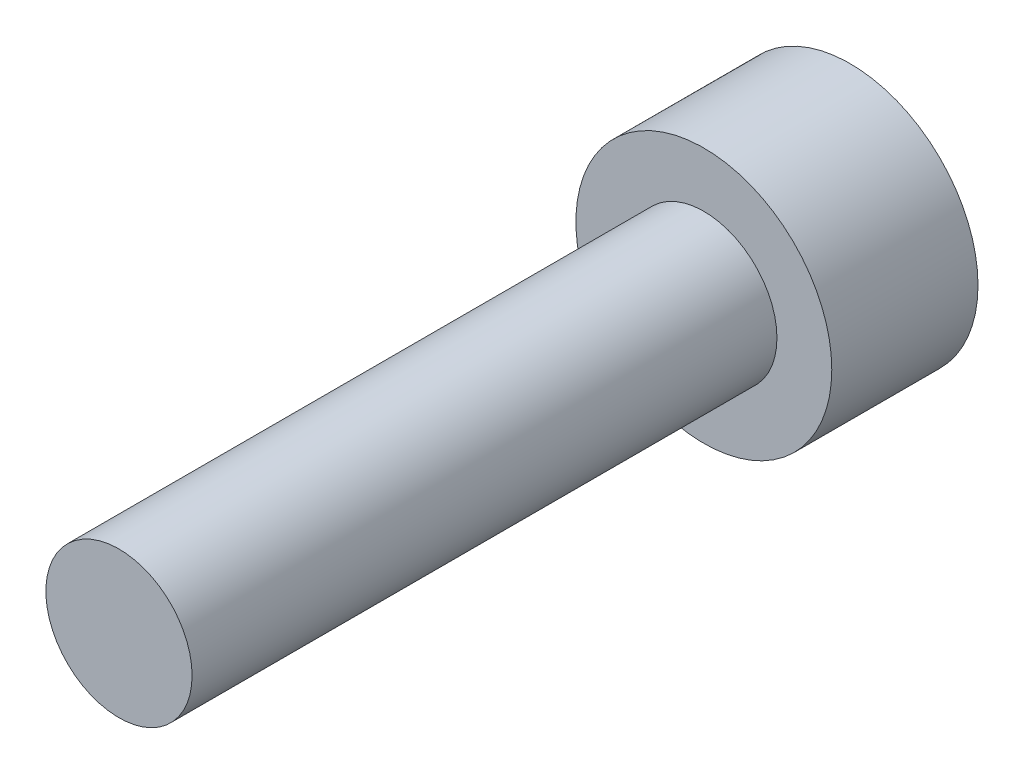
ISO-10303-21;
HEADER;
FILE_DESCRIPTION(('STEP AP214'),'2;1');
FILE_NAME('part.step','',(''),(''),'','','');
FILE_SCHEMA(('AUTOMOTIVE_DESIGN { 1 0 10303 214 1 1 1 1 }'));
ENDSEC;
DATA;
#1=APPLICATION_CONTEXT('core data for automotive mechanical design processes');
#2=APPLICATION_PROTOCOL_DEFINITION('international standard','automotive_design',2000,#1);
#3=PRODUCT_CONTEXT('',#1,'mechanical');
#4=PRODUCT('Part','Part','',(#3));
#5=PRODUCT_RELATED_PRODUCT_CATEGORY('part','',(#4));
#6=PRODUCT_DEFINITION_FORMATION('','',#4);
#7=PRODUCT_DEFINITION_CONTEXT('part definition',#1,'design');
#8=PRODUCT_DEFINITION('design','',#6,#7);
#9=PRODUCT_DEFINITION_SHAPE('','',#8);
#10=(LENGTH_UNIT() NAMED_UNIT(*) SI_UNIT(.MILLI.,.METRE.));
#11=(NAMED_UNIT(*) PLANE_ANGLE_UNIT() SI_UNIT($,.RADIAN.));
#12=(NAMED_UNIT(*) SI_UNIT($,.STERADIAN.) SOLID_ANGLE_UNIT());
#13=UNCERTAINTY_MEASURE_WITH_UNIT(LENGTH_MEASURE(1.E-05),#10,'distance_accuracy_value','');
#14=(GEOMETRIC_REPRESENTATION_CONTEXT(3) GLOBAL_UNCERTAINTY_ASSIGNED_CONTEXT((#13)) GLOBAL_UNIT_ASSIGNED_CONTEXT((#10,
#11,#12)) REPRESENTATION_CONTEXT('',''));
#15=CARTESIAN_POINT('',(0.,0.,0.));
#16=DIRECTION('',(0.,0.,1.));
#17=DIRECTION('',(1.,0.,0.));
#18=AXIS2_PLACEMENT_3D('',#15,#16,#17);
#19=CARTESIAN_POINT('',(0.,0.,16.));
#20=DIRECTION('',(0.,0.,1.));
#21=DIRECTION('',(1.,0.,0.));
#22=AXIS2_PLACEMENT_3D('',#19,#20,#21);
#23=PLANE('',#22);
#24=CARTESIAN_POINT('',(0.,0.,16.));
#25=DIRECTION('',(0.,0.,1.));
#26=DIRECTION('',(1.,0.,0.));
#27=AXIS2_PLACEMENT_3D('',#24,#25,#26);
#28=CIRCLE('',#27,2.);
#29=CARTESIAN_POINT('',(2.,0.,16.));
#30=VERTEX_POINT('',#29);
#31=EDGE_CURVE('E11',#30,#30,#28,.T.);
#32=ORIENTED_EDGE('',*,*,#31,.T.);
#33=EDGE_LOOP('',(#32));
#34=FACE_BOUND('',#33,.T.);
#35=ADVANCED_FACE('F33',(#34),#23,.T.);
#36=CARTESIAN_POINT('',(0.,0.,16.));
#37=DIRECTION('',(0.,0.,1.));
#38=DIRECTION('',(1.,0.,0.));
#39=AXIS2_PLACEMENT_3D('',#36,#37,#38);
#40=CYLINDRICAL_SURFACE('',#39,2.);
#41=CARTESIAN_POINT('',(0.,0.,0.));
#42=DIRECTION('',(0.,0.,1.));
#43=DIRECTION('',(1.,0.,0.));
#44=AXIS2_PLACEMENT_3D('',#41,#42,#43);
#45=CIRCLE('',#44,2.);
#46=CARTESIAN_POINT('',(2.,0.,0.));
#47=VERTEX_POINT('',#46);
#48=EDGE_CURVE('E40',#47,#47,#45,.T.);
#49=ORIENTED_EDGE('',*,*,#48,.T.);
#50=EDGE_LOOP('',(#49));
#51=FACE_BOUND('',#50,.T.);
#52=ORIENTED_EDGE('',*,*,#31,.F.);
#53=EDGE_LOOP('',(#52));
#54=FACE_BOUND('',#53,.T.);
#55=ADVANCED_FACE('F147',(#51,#54),#40,.T.);
#56=CARTESIAN_POINT('',(0.,-2.,0.));
#57=DIRECTION('',(0.,0.,1.));
#58=DIRECTION('',(1.,0.,0.));
#59=AXIS2_PLACEMENT_3D('',#56,#57,#58);
#60=PLANE('',#59);
#61=CARTESIAN_POINT('',(0.,0.,0.));
#62=DIRECTION('',(0.,0.,1.));
#63=DIRECTION('',(1.,0.,0.));
#64=AXIS2_PLACEMENT_3D('',#61,#62,#63);
#65=CIRCLE('',#64,3.5);
#66=CARTESIAN_POINT('',(3.5,0.,0.));
#67=VERTEX_POINT('',#66);
#68=EDGE_CURVE('E142',#67,#67,#65,.T.);
#69=ORIENTED_EDGE('',*,*,#68,.T.);
#70=EDGE_LOOP('',(#69));
#71=FACE_BOUND('',#70,.T.);
#72=ORIENTED_EDGE('',*,*,#48,.F.);
#73=EDGE_LOOP('',(#72));
#74=FACE_BOUND('',#73,.T.);
#75=ADVANCED_FACE('F150',(#71,#74),#60,.T.);
#76=CARTESIAN_POINT('',(0.,0.,16.));
#77=DIRECTION('',(0.,0.,1.));
#78=DIRECTION('',(1.,0.,0.));
#79=AXIS2_PLACEMENT_3D('',#76,#77,#78);
#80=CYLINDRICAL_SURFACE('',#79,3.5);
#81=CARTESIAN_POINT('',(0.,0.,-4.));
#82=DIRECTION('',(0.,0.,1.));
#83=DIRECTION('',(1.,0.,0.));
#84=AXIS2_PLACEMENT_3D('',#81,#82,#83);
#85=CIRCLE('',#84,3.5);
#86=CARTESIAN_POINT('',(3.5,0.,-4.));
#87=VERTEX_POINT('',#86);
#88=EDGE_CURVE('E134',#87,#87,#85,.T.);
#89=ORIENTED_EDGE('',*,*,#88,.T.);
#90=EDGE_LOOP('',(#89));
#91=FACE_BOUND('',#90,.T.);
#92=ORIENTED_EDGE('',*,*,#68,.F.);
#93=EDGE_LOOP('',(#92));
#94=FACE_BOUND('',#93,.T.);
#95=ADVANCED_FACE('F152',(#91,#94),#80,.T.);
#96=CARTESIAN_POINT('',(0.,-3.5,-4.));
#97=DIRECTION('',(0.,0.,-1.));
#98=DIRECTION('',(-1.,0.,0.));
#99=AXIS2_PLACEMENT_3D('',#96,#97,#98);
#100=PLANE('',#99);
#101=DIRECTION('',(0.866025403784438,-0.5,0.));
#102=VECTOR('',#101,1.);
#103=CARTESIAN_POINT('',(0.,1.73205080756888,-4.));
#104=LINE('',#103,#102);
#105=CARTESIAN_POINT('',(0.,1.73205080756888,-4.));
#106=VERTEX_POINT('',#105);
#107=CARTESIAN_POINT('',(1.5,0.866025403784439,-4.));
#108=VERTEX_POINT('',#107);
#109=EDGE_CURVE('E47',#106,#108,#104,.T.);
#110=ORIENTED_EDGE('',*,*,#109,.F.);
#111=DIRECTION('',(0.866025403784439,0.5,0.));
#112=VECTOR('',#111,1.);
#113=CARTESIAN_POINT('',(-1.5,0.866025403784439,-4.));
#114=LINE('',#113,#112);
#115=CARTESIAN_POINT('',(-1.5,0.866025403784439,-4.));
#116=VERTEX_POINT('',#115);
#117=EDGE_CURVE('E130',#116,#106,#114,.T.);
#118=ORIENTED_EDGE('',*,*,#117,.F.);
#119=DIRECTION('',(0.,1.,0.));
#120=VECTOR('',#119,1.);
#121=CARTESIAN_POINT('',(-1.5,-0.866025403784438,-4.));
#122=LINE('',#121,#120);
#123=CARTESIAN_POINT('',(-1.5,-0.866025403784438,-4.));
#124=VERTEX_POINT('',#123);
#125=EDGE_CURVE('E128',#124,#116,#122,.T.);
#126=ORIENTED_EDGE('',*,*,#125,.F.);
#127=DIRECTION('',(-0.866025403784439,0.5,0.));
#128=VECTOR('',#127,1.);
#129=CARTESIAN_POINT('',(0.,-1.73205080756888,-4.));
#130=LINE('',#129,#128);
#131=CARTESIAN_POINT('',(0.,-1.73205080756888,-4.));
#132=VERTEX_POINT('',#131);
#133=EDGE_CURVE('E95',#132,#124,#130,.T.);
#134=ORIENTED_EDGE('',*,*,#133,.F.);
#135=DIRECTION('',(-0.866025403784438,-0.5,0.));
#136=VECTOR('',#135,1.);
#137=CARTESIAN_POINT('',(1.5,-0.866025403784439,-4.));
#138=LINE('',#137,#136);
#139=CARTESIAN_POINT('',(1.5,-0.866025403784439,-4.));
#140=VERTEX_POINT('',#139);
#141=EDGE_CURVE('E124',#140,#132,#138,.T.);
#142=ORIENTED_EDGE('',*,*,#141,.F.);
#143=DIRECTION('',(0.,-1.,0.));
#144=VECTOR('',#143,1.);
#145=CARTESIAN_POINT('',(1.5,0.866025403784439,-4.));
#146=LINE('',#145,#144);
#147=EDGE_CURVE('E121',#108,#140,#146,.T.);
#148=ORIENTED_EDGE('',*,*,#147,.F.);
#149=EDGE_LOOP('',(#110,#118,#126,#134,#142,#148));
#150=FACE_BOUND('',#149,.T.);
#151=ORIENTED_EDGE('',*,*,#88,.F.);
#152=EDGE_LOOP('',(#151));
#153=FACE_BOUND('',#152,.T.);
#154=ADVANCED_FACE('F159',(#150,#153),#100,.T.);
#155=CARTESIAN_POINT('',(0.,1.73205080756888,-1.));
#156=DIRECTION('',(0.5,0.866025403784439,0.));
#157=DIRECTION('',(-0.866025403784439,0.5,0.));
#158=AXIS2_PLACEMENT_3D('',#155,#156,#157);
#159=PLANE('',#158);
#160=ORIENTED_EDGE('',*,*,#109,.T.);
#161=DIRECTION('',(0.,0.,-1.));
#162=VECTOR('',#161,1.);
#163=CARTESIAN_POINT('',(1.5,0.866025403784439,-1.));
#164=LINE('',#163,#162);
#165=CARTESIAN_POINT('',(1.5,0.866025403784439,-1.));
#166=VERTEX_POINT('',#165);
#167=EDGE_CURVE('E77',#166,#108,#164,.T.);
#168=ORIENTED_EDGE('',*,*,#167,.F.);
#169=DIRECTION('',(0.866025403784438,-0.5,0.));
#170=VECTOR('',#169,1.);
#171=CARTESIAN_POINT('',(0.,1.73205080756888,-1.));
#172=LINE('',#171,#170);
#173=CARTESIAN_POINT('',(0.,1.73205080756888,-1.));
#174=VERTEX_POINT('',#173);
#175=EDGE_CURVE('E132',#174,#166,#172,.T.);
#176=ORIENTED_EDGE('',*,*,#175,.F.);
#177=DIRECTION('',(0.,0.,-1.));
#178=VECTOR('',#177,1.);
#179=CARTESIAN_POINT('',(0.,1.73205080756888,-1.));
#180=LINE('',#179,#178);
#181=EDGE_CURVE('E55',#174,#106,#180,.T.);
#182=ORIENTED_EDGE('',*,*,#181,.T.);
#183=EDGE_LOOP('',(#160,#168,#176,#182));
#184=FACE_BOUND('',#183,.T.);
#185=ADVANCED_FACE('F190',(#184),#159,.F.);
#186=CARTESIAN_POINT('',(-1.5,0.866025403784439,-1.));
#187=DIRECTION('',(-0.5,0.866025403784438,0.));
#188=DIRECTION('',(-0.866025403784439,-0.5,0.));
#189=AXIS2_PLACEMENT_3D('',#186,#187,#188);
#190=PLANE('',#189);
#191=ORIENTED_EDGE('',*,*,#117,.T.);
#192=ORIENTED_EDGE('',*,*,#181,.F.);
#193=DIRECTION('',(0.866025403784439,0.5,0.));
#194=VECTOR('',#193,1.);
#195=CARTESIAN_POINT('',(-1.5,0.866025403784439,-1.));
#196=LINE('',#195,#194);
#197=CARTESIAN_POINT('',(-1.5,0.866025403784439,-1.));
#198=VERTEX_POINT('',#197);
#199=EDGE_CURVE('E107',#198,#174,#196,.T.);
#200=ORIENTED_EDGE('',*,*,#199,.F.);
#201=DIRECTION('',(0.,0.,-1.));
#202=VECTOR('',#201,1.);
#203=CARTESIAN_POINT('',(-1.5,0.866025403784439,-1.));
#204=LINE('',#203,#202);
#205=EDGE_CURVE('E99',#198,#116,#204,.T.);
#206=ORIENTED_EDGE('',*,*,#205,.T.);
#207=EDGE_LOOP('',(#191,#192,#200,#206));
#208=FACE_BOUND('',#207,.T.);
#209=ADVANCED_FACE('F200',(#208),#190,.F.);
#210=CARTESIAN_POINT('',(-1.5,-0.866025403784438,-1.));
#211=DIRECTION('',(-1.,0.,0.));
#212=DIRECTION('',(0.,0.,1.));
#213=AXIS2_PLACEMENT_3D('',#210,#211,#212);
#214=PLANE('',#213);
#215=ORIENTED_EDGE('',*,*,#125,.T.);
#216=ORIENTED_EDGE('',*,*,#205,.F.);
#217=DIRECTION('',(0.,1.,0.));
#218=VECTOR('',#217,1.);
#219=CARTESIAN_POINT('',(-1.5,-0.866025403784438,-1.));
#220=LINE('',#219,#218);
#221=CARTESIAN_POINT('',(-1.5,-0.866025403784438,-1.));
#222=VERTEX_POINT('',#221);
#223=EDGE_CURVE('E103',#222,#198,#220,.T.);
#224=ORIENTED_EDGE('',*,*,#223,.F.);
#225=DIRECTION('',(0.,0.,-1.));
#226=VECTOR('',#225,1.);
#227=CARTESIAN_POINT('',(-1.5,-0.866025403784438,-1.));
#228=LINE('',#227,#226);
#229=EDGE_CURVE('E88',#222,#124,#228,.T.);
#230=ORIENTED_EDGE('',*,*,#229,.T.);
#231=EDGE_LOOP('',(#215,#216,#224,#230));
#232=FACE_BOUND('',#231,.T.);
#233=ADVANCED_FACE('F104',(#232),#214,.F.);
#234=CARTESIAN_POINT('',(0.,-1.73205080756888,-1.));
#235=DIRECTION('',(-0.5,-0.866025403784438,0.));
#236=DIRECTION('',(0.866025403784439,-0.5,0.));
#237=AXIS2_PLACEMENT_3D('',#234,#235,#236);
#238=PLANE('',#237);
#239=ORIENTED_EDGE('',*,*,#133,.T.);
#240=ORIENTED_EDGE('',*,*,#229,.F.);
#241=DIRECTION('',(-0.866025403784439,0.5,0.));
#242=VECTOR('',#241,1.);
#243=CARTESIAN_POINT('',(0.,-1.73205080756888,-1.));
#244=LINE('',#243,#242);
#245=CARTESIAN_POINT('',(0.,-1.73205080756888,-1.));
#246=VERTEX_POINT('',#245);
#247=EDGE_CURVE('E92',#246,#222,#244,.T.);
#248=ORIENTED_EDGE('',*,*,#247,.F.);
#249=DIRECTION('',(0.,0.,-1.));
#250=VECTOR('',#249,1.);
#251=CARTESIAN_POINT('',(0.,-1.73205080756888,-1.));
#252=LINE('',#251,#250);
#253=EDGE_CURVE('E100',#246,#132,#252,.T.);
#254=ORIENTED_EDGE('',*,*,#253,.T.);
#255=EDGE_LOOP('',(#239,#240,#248,#254));
#256=FACE_BOUND('',#255,.T.);
#257=ADVANCED_FACE('F90',(#256),#238,.F.);
#258=CARTESIAN_POINT('',(1.5,-0.866025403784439,-1.));
#259=DIRECTION('',(0.5,-0.866025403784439,0.));
#260=DIRECTION('',(0.866025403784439,0.5,0.));
#261=AXIS2_PLACEMENT_3D('',#258,#259,#260);
#262=PLANE('',#261);
#263=ORIENTED_EDGE('',*,*,#141,.T.);
#264=ORIENTED_EDGE('',*,*,#253,.F.);
#265=DIRECTION('',(-0.866025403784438,-0.5,0.));
#266=VECTOR('',#265,1.);
#267=CARTESIAN_POINT('',(1.5,-0.866025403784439,-1.));
#268=LINE('',#267,#266);
#269=CARTESIAN_POINT('',(1.5,-0.866025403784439,-1.));
#270=VERTEX_POINT('',#269);
#271=EDGE_CURVE('E113',#270,#246,#268,.T.);
#272=ORIENTED_EDGE('',*,*,#271,.F.);
#273=DIRECTION('',(0.,0.,-1.));
#274=VECTOR('',#273,1.);
#275=CARTESIAN_POINT('',(1.5,-0.866025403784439,-1.));
#276=LINE('',#275,#274);
#277=EDGE_CURVE('E137',#270,#140,#276,.T.);
#278=ORIENTED_EDGE('',*,*,#277,.T.);
#279=EDGE_LOOP('',(#263,#264,#272,#278));
#280=FACE_BOUND('',#279,.T.);
#281=ADVANCED_FACE('F225',(#280),#262,.F.);
#282=CARTESIAN_POINT('',(1.5,0.866025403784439,-1.));
#283=DIRECTION('',(1.,0.,0.));
#284=DIRECTION('',(0.,0.,-1.));
#285=AXIS2_PLACEMENT_3D('',#282,#283,#284);
#286=PLANE('',#285);
#287=ORIENTED_EDGE('',*,*,#147,.T.);
#288=ORIENTED_EDGE('',*,*,#277,.F.);
#289=DIRECTION('',(0.,-1.,0.));
#290=VECTOR('',#289,1.);
#291=CARTESIAN_POINT('',(1.5,0.866025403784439,-1.));
#292=LINE('',#291,#290);
#293=EDGE_CURVE('E115',#166,#270,#292,.T.);
#294=ORIENTED_EDGE('',*,*,#293,.F.);
#295=ORIENTED_EDGE('',*,*,#167,.T.);
#296=EDGE_LOOP('',(#287,#288,#294,#295));
#297=FACE_BOUND('',#296,.T.);
#298=ADVANCED_FACE('F234',(#297),#286,.F.);
#299=CARTESIAN_POINT('',(3.,0.,-1.));
#300=DIRECTION('',(0.,0.,-1.));
#301=DIRECTION('',(-1.,0.,0.));
#302=AXIS2_PLACEMENT_3D('',#299,#300,#301);
#303=PLANE('',#302);
#304=ORIENTED_EDGE('',*,*,#175,.T.);
#305=ORIENTED_EDGE('',*,*,#293,.T.);
#306=ORIENTED_EDGE('',*,*,#271,.T.);
#307=ORIENTED_EDGE('',*,*,#247,.T.);
#308=ORIENTED_EDGE('',*,*,#223,.T.);
#309=ORIENTED_EDGE('',*,*,#199,.T.);
#310=EDGE_LOOP('',(#304,#305,#306,#307,#308,#309));
#311=FACE_BOUND('',#310,.T.);
#312=ADVANCED_FACE('F110',(#311),#303,.T.);
#313=CLOSED_SHELL('',(#35,#55,#75,#95,#154,#185,#209,#233,#257,#281,#298,#312));
#314=MANIFOLD_SOLID_BREP('B2',#313);
#315=ADVANCED_BREP_SHAPE_REPRESENTATION('',(#18,#314),#14);
#316=SHAPE_DEFINITION_REPRESENTATION(#9,#315);
ENDSEC;
END-ISO-10303-21;
